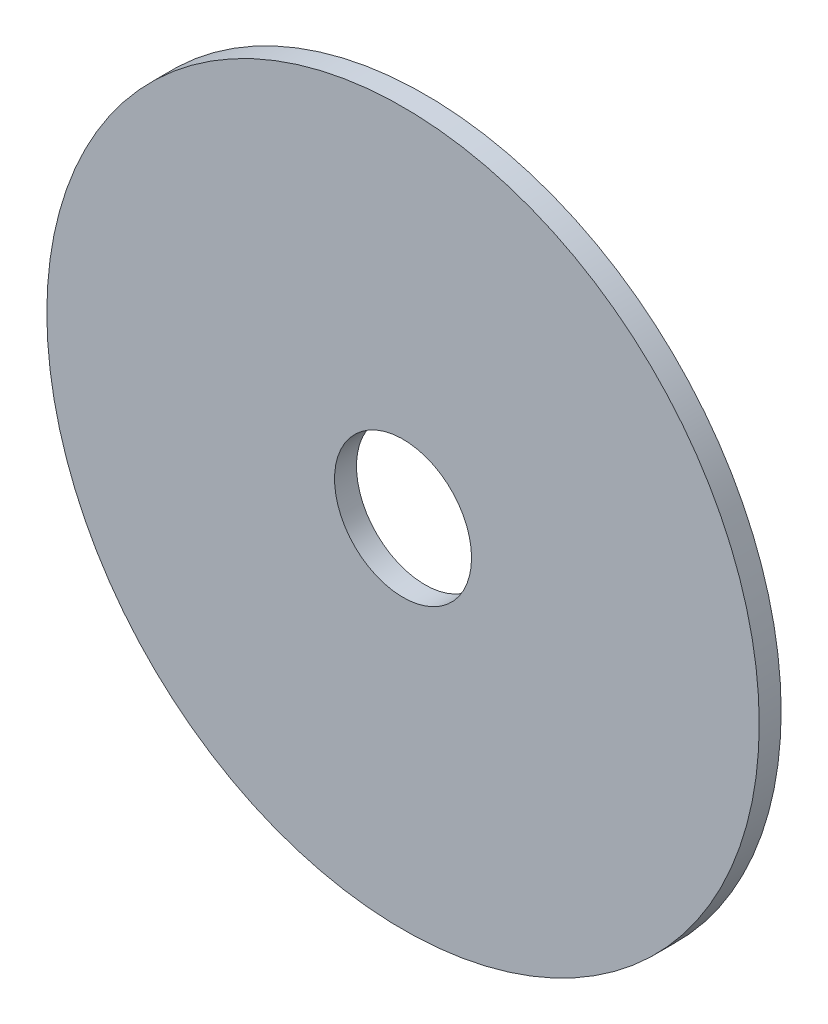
from build123d import *

# Parameters (mm, degrees)
ESQUISSE1_R      = 32.5
ESQUISSE1_R_2    = 6.25
EXTRUSION1_DEPTH = 2


with BuildPart() as part:
    # Esquisse1 → Extrusion1 (new body)
    with BuildSketch(Plane.XY):
        Circle(ESQUISSE1_R)
        Circle(ESQUISSE1_R_2, mode=Mode.SUBTRACT)
    extrude(amount=EXTRUSION1_DEPTH)


solid = part.part
